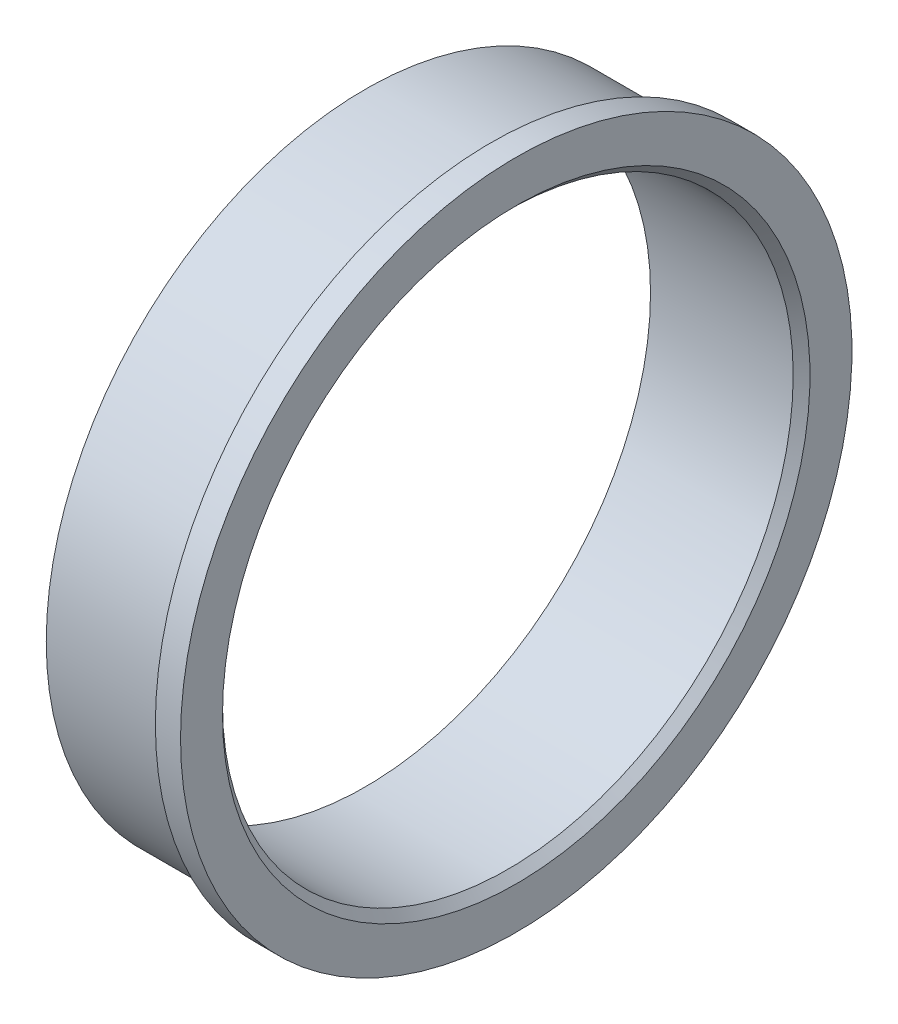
ISO-10303-21;
HEADER;
FILE_DESCRIPTION(('STEP AP214'),'2;1');
FILE_NAME('part.step','',(''),(''),'','','');
FILE_SCHEMA(('AUTOMOTIVE_DESIGN { 1 0 10303 214 1 1 1 1 }'));
ENDSEC;
DATA;
#1=APPLICATION_CONTEXT('core data for automotive mechanical design processes');
#2=APPLICATION_PROTOCOL_DEFINITION('international standard','automotive_design',2000,#1);
#3=PRODUCT_CONTEXT('',#1,'mechanical');
#4=PRODUCT('Part','Part','',(#3));
#5=PRODUCT_RELATED_PRODUCT_CATEGORY('part','',(#4));
#6=PRODUCT_DEFINITION_FORMATION('','',#4);
#7=PRODUCT_DEFINITION_CONTEXT('part definition',#1,'design');
#8=PRODUCT_DEFINITION('design','',#6,#7);
#9=PRODUCT_DEFINITION_SHAPE('','',#8);
#10=(LENGTH_UNIT() NAMED_UNIT(*) SI_UNIT(.MILLI.,.METRE.));
#11=(NAMED_UNIT(*) PLANE_ANGLE_UNIT() SI_UNIT($,.RADIAN.));
#12=(NAMED_UNIT(*) SI_UNIT($,.STERADIAN.) SOLID_ANGLE_UNIT());
#13=UNCERTAINTY_MEASURE_WITH_UNIT(LENGTH_MEASURE(1.E-05),#10,'distance_accuracy_value','');
#14=(GEOMETRIC_REPRESENTATION_CONTEXT(3) GLOBAL_UNCERTAINTY_ASSIGNED_CONTEXT((#13)) GLOBAL_UNIT_ASSIGNED_CONTEXT((#10,
#11,#12)) REPRESENTATION_CONTEXT('',''));
#15=CARTESIAN_POINT('',(0.,0.,0.));
#16=DIRECTION('',(0.,0.,1.));
#17=DIRECTION('',(1.,0.,0.));
#18=AXIS2_PLACEMENT_3D('',#15,#16,#17);
#19=CARTESIAN_POINT('',(0.,17.,0.));
#20=DIRECTION('',(1.00000000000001,0.,0.));
#21=DIRECTION('',(0.,0.,-1.));
#22=AXIS2_PLACEMENT_3D('',#19,#20,#21);
#23=PLANE('',#22);
#24=CARTESIAN_POINT('',(0.,0.,0.));
#25=DIRECTION('',(-1.00000000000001,0.,0.));
#26=DIRECTION('',(0.,0.,1.));
#27=AXIS2_PLACEMENT_3D('',#24,#25,#26);
#28=CIRCLE('',#27,17.);
#29=CARTESIAN_POINT('',(0.,0.,17.));
#30=VERTEX_POINT('',#29);
#31=EDGE_CURVE('E57',#30,#30,#28,.T.);
#32=ORIENTED_EDGE('',*,*,#31,.F.);
#33=EDGE_LOOP('',(#32));
#34=FACE_BOUND('',#33,.T.);
#35=CARTESIAN_POINT('',(0.,0.,0.));
#36=DIRECTION('',(-1.00000000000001,0.,0.));
#37=DIRECTION('',(0.,0.,1.));
#38=AXIS2_PLACEMENT_3D('',#35,#36,#37);
#39=CIRCLE('',#38,19.);
#40=CARTESIAN_POINT('',(0.,0.,19.));
#41=VERTEX_POINT('',#40);
#42=EDGE_CURVE('E10',#41,#41,#39,.T.);
#43=ORIENTED_EDGE('',*,*,#42,.T.);
#44=EDGE_LOOP('',(#43));
#45=FACE_BOUND('',#44,.T.);
#46=ADVANCED_FACE('F32',(#34,#45),#23,.F.);
#47=CARTESIAN_POINT('',(0.,0.,0.));
#48=DIRECTION('',(-1.00000000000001,0.,0.));
#49=DIRECTION('',(0.,0.,1.));
#50=AXIS2_PLACEMENT_3D('',#47,#48,#49);
#51=CYLINDRICAL_SURFACE('',#50,19.);
#52=ORIENTED_EDGE('',*,*,#42,.F.);
#53=EDGE_LOOP('',(#52));
#54=FACE_BOUND('',#53,.T.);
#55=CARTESIAN_POINT('',(7.50000000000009,0.,0.));
#56=DIRECTION('',(-1.00000000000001,0.,0.));
#57=DIRECTION('',(0.,0.,1.));
#58=AXIS2_PLACEMENT_3D('',#55,#56,#57);
#59=CIRCLE('',#58,19.);
#60=CARTESIAN_POINT('',(7.50000000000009,0.,19.));
#61=VERTEX_POINT('',#60);
#62=EDGE_CURVE('E38',#61,#61,#59,.T.);
#63=ORIENTED_EDGE('',*,*,#62,.T.);
#64=EDGE_LOOP('',(#63));
#65=FACE_BOUND('',#64,.T.);
#66=ADVANCED_FACE('F64',(#54,#65),#51,.T.);
#67=CARTESIAN_POINT('',(7.50000000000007,19.,0.));
#68=DIRECTION('',(1.00000000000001,0.,0.));
#69=DIRECTION('',(0.,0.,-1.));
#70=AXIS2_PLACEMENT_3D('',#67,#68,#69);
#71=PLANE('',#70);
#72=ORIENTED_EDGE('',*,*,#62,.F.);
#73=EDGE_LOOP('',(#72));
#74=FACE_BOUND('',#73,.T.);
#75=CARTESIAN_POINT('',(7.50000000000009,0.,0.));
#76=DIRECTION('',(-1.00000000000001,0.,0.));
#77=DIRECTION('',(0.,0.,1.));
#78=AXIS2_PLACEMENT_3D('',#75,#76,#77);
#79=CIRCLE('',#78,20.);
#80=CARTESIAN_POINT('',(7.50000000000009,0.,20.));
#81=VERTEX_POINT('',#80);
#82=EDGE_CURVE('E42',#81,#81,#79,.T.);
#83=ORIENTED_EDGE('',*,*,#82,.T.);
#84=EDGE_LOOP('',(#83));
#85=FACE_BOUND('',#84,.T.);
#86=ADVANCED_FACE('F68',(#74,#85),#71,.F.);
#87=CARTESIAN_POINT('',(0.,0.,0.));
#88=DIRECTION('',(-1.00000000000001,0.,0.));
#89=DIRECTION('',(0.,0.,1.));
#90=AXIS2_PLACEMENT_3D('',#87,#88,#89);
#91=CYLINDRICAL_SURFACE('',#90,20.);
#92=ORIENTED_EDGE('',*,*,#82,.F.);
#93=EDGE_LOOP('',(#92));
#94=FACE_BOUND('',#93,.T.);
#95=CARTESIAN_POINT('',(9.00000000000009,0.,0.));
#96=DIRECTION('',(-1.00000000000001,0.,0.));
#97=DIRECTION('',(0.,0.,1.));
#98=AXIS2_PLACEMENT_3D('',#95,#96,#97);
#99=CIRCLE('',#98,20.);
#100=CARTESIAN_POINT('',(9.00000000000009,0.,20.));
#101=VERTEX_POINT('',#100);
#102=EDGE_CURVE('E46',#101,#101,#99,.T.);
#103=ORIENTED_EDGE('',*,*,#102,.T.);
#104=EDGE_LOOP('',(#103));
#105=FACE_BOUND('',#104,.T.);
#106=ADVANCED_FACE('F73',(#94,#105),#91,.T.);
#107=CARTESIAN_POINT('',(9.00000000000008,20.,0.));
#108=DIRECTION('',(-1.00000000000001,0.,0.));
#109=DIRECTION('',(0.,0.,1.));
#110=AXIS2_PLACEMENT_3D('',#107,#108,#109);
#111=PLANE('',#110);
#112=ORIENTED_EDGE('',*,*,#102,.F.);
#113=EDGE_LOOP('',(#112));
#114=FACE_BOUND('',#113,.T.);
#115=CARTESIAN_POINT('',(9.00000000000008,0.,0.));
#116=DIRECTION('',(-1.00000000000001,0.,0.));
#117=DIRECTION('',(0.,0.,1.));
#118=AXIS2_PLACEMENT_3D('',#115,#116,#117);
#119=CIRCLE('',#118,17.5);
#120=CARTESIAN_POINT('',(9.00000000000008,0.,17.5));
#121=VERTEX_POINT('',#120);
#122=EDGE_CURVE('E51',#121,#121,#119,.T.);
#123=ORIENTED_EDGE('',*,*,#122,.T.);
#124=EDGE_LOOP('',(#123));
#125=FACE_BOUND('',#124,.T.);
#126=ADVANCED_FACE('F79',(#114,#125),#111,.F.);
#127=CARTESIAN_POINT('',(8.50000000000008,0.,0.));
#128=DIRECTION('',(1.00000000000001,0.,0.));
#129=DIRECTION('',(0.,0.,-1.));
#130=AXIS2_PLACEMENT_3D('',#127,#128,#129);
#131=CONICAL_SURFACE('',#130,17.,0.785398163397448);
#132=ORIENTED_EDGE('',*,*,#122,.F.);
#133=EDGE_LOOP('',(#132));
#134=FACE_BOUND('',#133,.T.);
#135=CARTESIAN_POINT('',(8.50000000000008,0.,0.));
#136=DIRECTION('',(-1.00000000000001,0.,0.));
#137=DIRECTION('',(0.,0.,1.));
#138=AXIS2_PLACEMENT_3D('',#135,#136,#137);
#139=CIRCLE('',#138,17.);
#140=CARTESIAN_POINT('',(8.50000000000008,0.,17.));
#141=VERTEX_POINT('',#140);
#142=EDGE_CURVE('E54',#141,#141,#139,.T.);
#143=ORIENTED_EDGE('',*,*,#142,.T.);
#144=EDGE_LOOP('',(#143));
#145=FACE_BOUND('',#144,.T.);
#146=ADVANCED_FACE('F83',(#134,#145),#131,.F.);
#147=CARTESIAN_POINT('',(0.,0.,0.));
#148=DIRECTION('',(-1.00000000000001,0.,0.));
#149=DIRECTION('',(0.,0.,1.));
#150=AXIS2_PLACEMENT_3D('',#147,#148,#149);
#151=CYLINDRICAL_SURFACE('',#150,17.);
#152=ORIENTED_EDGE('',*,*,#142,.F.);
#153=EDGE_LOOP('',(#152));
#154=FACE_BOUND('',#153,.T.);
#155=ORIENTED_EDGE('',*,*,#31,.T.);
#156=EDGE_LOOP('',(#155));
#157=FACE_BOUND('',#156,.T.);
#158=ADVANCED_FACE('F61',(#154,#157),#151,.F.);
#159=CLOSED_SHELL('',(#46,#66,#86,#106,#126,#146,#158));
#160=MANIFOLD_SOLID_BREP('B2',#159);
#161=ADVANCED_BREP_SHAPE_REPRESENTATION('',(#18,#160),#14);
#162=SHAPE_DEFINITION_REPRESENTATION(#9,#161);
ENDSEC;
END-ISO-10303-21;
